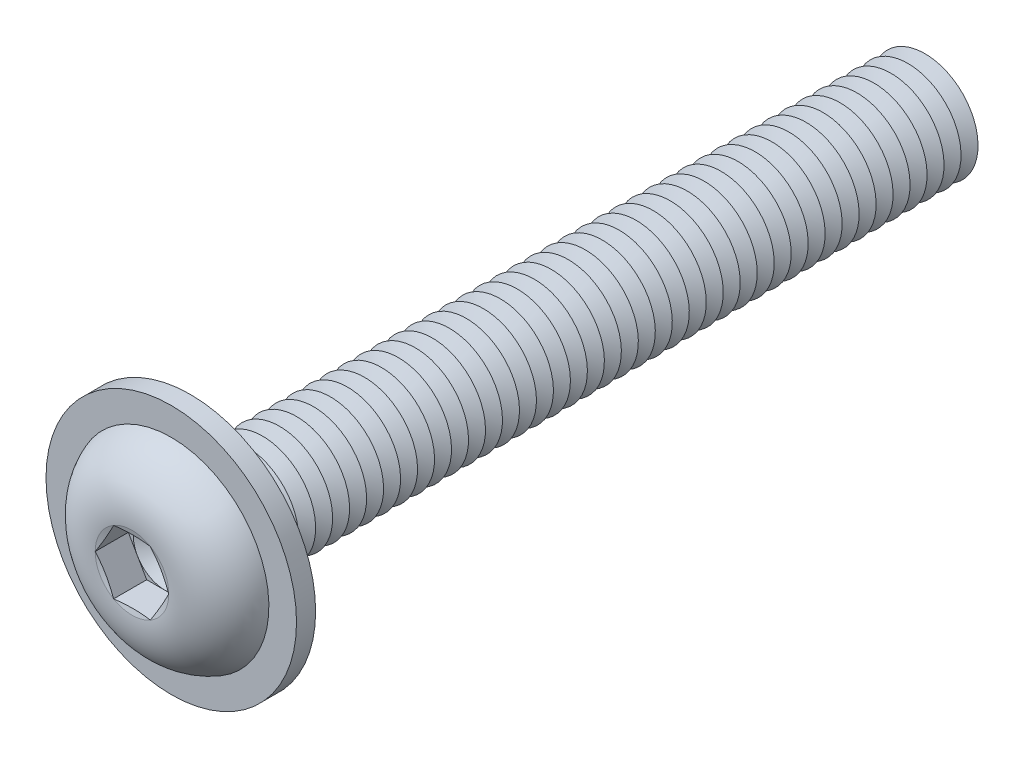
from build123d import *

# Parameters (mm, degrees)
FILLET1_R           = 0.4
LPATTERN1_COUNT     = 43
LPATTERN1_PITCH     = 0.8
CUT_EXTRUDE1_DEPTH  = 1.56
SKETCH5_R           = 5.9
SKETCH5_R_2         = 2.9
BOSS_EXTRUDE1_DEPTH = 0.9


with BuildPart() as part:
    # Sketch1 → Revolve1 (revolve)
    with BuildSketch(Plane(origin=(0, 0, 0), x_dir=(0, 0, -1), z_dir=(1, 0, 0))):
        with BuildLine():
            Line((0, 2.5), (0, 4.75))
            ThreePointArc((0, 4.75), (-2.041477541, 3.848329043), (-2.75, 1.73205))
            Line((-2.75, 1.73205), (-2.517949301, 0.866025))
            Line((-2.517949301, 0.866025), (-2.75, 0.866025))
            Line((-2.75, 0.866025), (-2.75, 0))
            Line((-2.75, 0), (35, 0))
            Line((35, 0), (35, 2.5))
            Line((35, 2.5), (0, 2.5))
        make_face()
    revolve(axis=Axis((0, 0, -35), (0, 0, 1)))

    # Fillet1
    fillet1_edges = [part.edges().sort_by_distance(p)[0] for p in [
        (0, -2.5, 0),
    ]]
    fillet(fillet1_edges, radius=FILLET1_R)

    # Sketch2 → Cut-Revolve1 (revolve, cut)
    with BuildSketch(Plane(origin=(0, 0, 0), x_dir=(0, 0, -1), z_dir=(1, 0, 0))):
        Polygon((34.6, 2.5), (35.4, 2.5), (35, 1.807179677), align=None)
    cut_revolve1 = revolve(axis=Axis((0, 0, -35), (0, 0, -1)), mode=Mode.SUBTRACT)

    # LPattern1: Cut-Revolve1 ×43
    with Locations(*[(0, 0, i * LPATTERN1_PITCH) for i in range(1, LPATTERN1_COUNT)]):
        add(cut_revolve1, mode=Mode.SUBTRACT)

    # Sketch3 → Cut-Extrude1 (cut)
    with BuildSketch(Plane.XY.offset(2.75)):
        Polygon((0.866025, 1.499999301), (-0.866025, 1.499999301), (-1.73205, 0), (-0.866025, -1.499999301), (0.866025, -1.499999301), (1.73205, 0), align=None)
    extrude(amount=-CUT_EXTRUDE1_DEPTH, mode=Mode.SUBTRACT)

    # Cut-Extrude2 cone 1 section (on through the dimple's axis) → Cut-Extrude2 (revolve, cut)
    with BuildSketch(Plane(origin=(0, 0, 1.19), x_dir=(0, -1, 0), z_dir=(1, 0, 0))):
        Polygon((0, 0), (1.499999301, 0), (0, 0.866025), align=None)
    revolve(axis=Axis((0, 0, 1.19), (0, 0, -1)), mode=Mode.SUBTRACT)

    # Sketch5 → Boss-Extrude1 (add)
    with BuildSketch(Plane(origin=(0, 0, 0), x_dir=(-1, 0, 0), z_dir=(0, 0, -1))):
        with Locations(Location((0, 0, 0), (0, 0, 90))):
            Circle(SKETCH5_R)
        Circle(SKETCH5_R_2, mode=Mode.SUBTRACT)
    extrude(amount=-BOSS_EXTRUDE1_DEPTH)


solid = part.part
